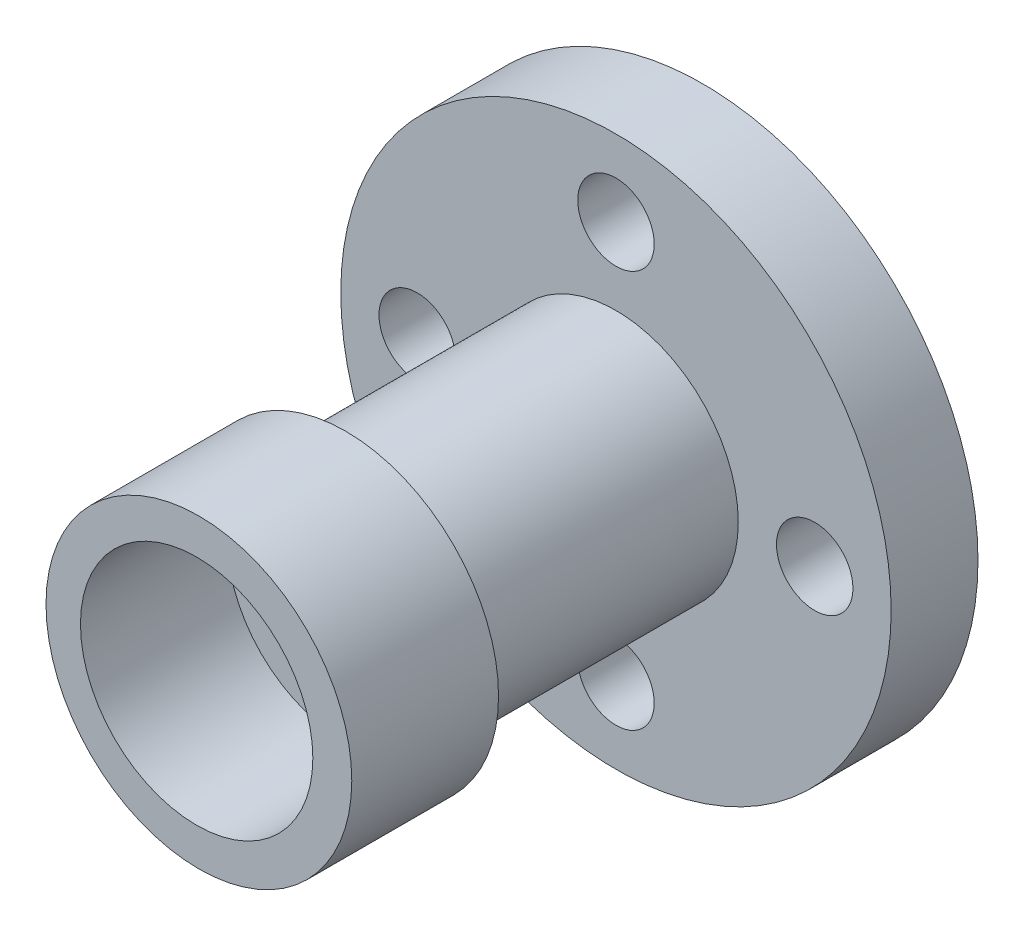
from build123d import *

# Parameters (mm, degrees)
CROQUIS1_R              = 45
CROQUIS1_R_2            = 15
SALIENTE_EXTRUIR1_DEPTH = 14.2
CROQUIS3_R              = 20
CROQUIS3_R_2            = 15
SALIENTE_EXTRUIR2_DEPTH = 44.2
CROQUIS6_R              = 25
CROQUIS6_R_2            = 19
SALIENTE_EXTRUIR3_DEPTH = 24
CHAFL_N1_SIZE           = 3
CHAFL_N1_SIZE2          = 3.5
CROQUIS10_R             = 6.25
CORTAR_EXTRUIR1_DEPTH   = 44.2


with BuildPart() as part:
    # Croquis1 → Saliente-Extruir1 (new body)
    with BuildSketch(Plane.XY):
        Circle(CROQUIS1_R)
        Circle(CROQUIS1_R_2, mode=Mode.SUBTRACT)
    extrude(amount=SALIENTE_EXTRUIR1_DEPTH)

    # Croquis3 → Saliente-Extruir2 (add)
    with BuildSketch(Plane.XY.offset(14.2)):
        Circle(CROQUIS3_R)
        Circle(CROQUIS3_R_2, mode=Mode.SUBTRACT)
    extrude(amount=SALIENTE_EXTRUIR2_DEPTH)

    # Croquis6 → Saliente-Extruir3 (add)
    with BuildSketch(Plane.XY.offset(58.4)):
        Circle(CROQUIS6_R)
        with Locations((-0.365479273, 0)):
            Circle(CROQUIS6_R_2, mode=Mode.SUBTRACT)
    extrude(amount=SALIENTE_EXTRUIR3_DEPTH)

    # Chafl_n1
    chafl_n1_edges = [part.edges().sort_by_distance(p)[0] for p in [
        (-15, 0, 0),
    ]]
    chafl_n1_side = [part.faces().sort_by_distance(p)[0] for p in [
        (-15, 0, 29.2),
    ]]
    chamfer(chafl_n1_edges, length=CHAFL_N1_SIZE, length2=CHAFL_N1_SIZE2, reference=chafl_n1_side[0])

    # Croquis10 → Cortar-Extruir1 (cut)
    with BuildSketch(Plane(origin=(0, 0, 0), x_dir=(-1, 0, 0), z_dir=(0, 0, -1))):
        with Locations((0, 32.5)):
            Circle(CROQUIS10_R)
        with Locations((32.5, 0)):
            Circle(CROQUIS10_R)
        with Locations((0, -32.5)):
            Circle(CROQUIS10_R)
        with Locations((-32.5, 0)):
            Circle(CROQUIS10_R)
    extrude(amount=-CORTAR_EXTRUIR1_DEPTH, mode=Mode.SUBTRACT)


solid = part.part
